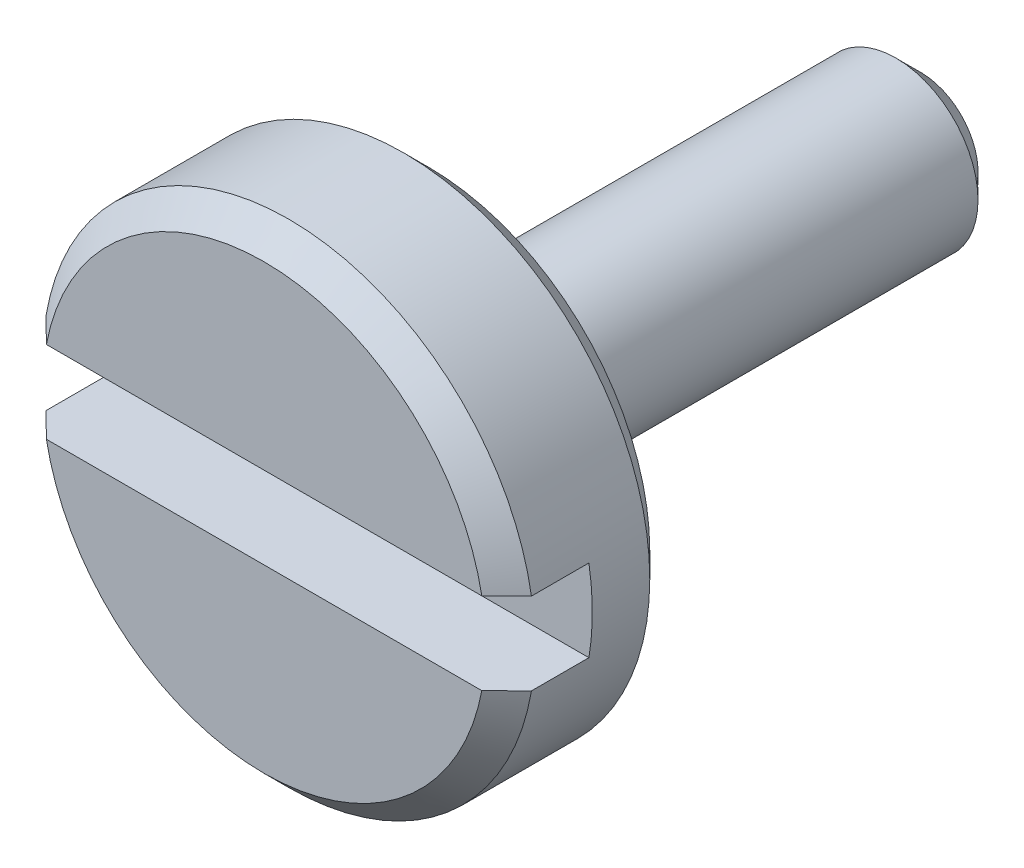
from build123d import *

# Parameters (mm, degrees)
ESQUISSE1_R             = 30
BOSS_EXTRU_1_DEPTH      = 20
CHANFREIN1_SIZE         = 3
CHANFREIN2_SIZE         = 3
ESQUISSE2_W             = 66.537903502
ESQUISSE2_H             = 10
ENL_V_MAT_EXTRU_1_DEPTH = 10
ESQUISSE4_R             = 10
BOSS_EXTRU_2_DEPTH      = 60
CHANFREIN3_SIZE         = 3
ESQUISSE6_R             = 10
ENL_V_MAT_EXTRU_3_DEPTH = 1.25
ENL_V_MAT_EXTRU_4_DEPTH = 1


with BuildPart() as part:
    # Esquisse1 → Boss.-Extru.1 (new body)
    with BuildSketch(Plane.XY):
        Circle(ESQUISSE1_R)
    extrude(amount=BOSS_EXTRU_1_DEPTH)

    # Chanfrein1
    chanfrein1_edges = [part.edges().sort_by_distance(p)[0] for p in [
        (-30, 0, 20),
    ]]
    chamfer(chanfrein1_edges, length=CHANFREIN1_SIZE)

    # Chanfrein2
    chanfrein2_edges = [part.edges().sort_by_distance(p)[0] for p in [
        (-30, 0, 0),
    ]]
    chamfer(chanfrein2_edges, length=CHANFREIN2_SIZE)

    # Esquisse2 → Enl_v. mat.-Extru.1 (cut)
    with BuildSketch(Plane.XY.offset(20)):
        with Locations((1.429332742, 0)):
            Rectangle(ESQUISSE2_W, ESQUISSE2_H)
    extrude(amount=-ENL_V_MAT_EXTRU_1_DEPTH, mode=Mode.SUBTRACT)

    # Esquisse4 → Boss.-Extru.2 (add)
    with BuildSketch(Plane(origin=(0, 0, 0), x_dir=(-1, 0, 0), z_dir=(0, 0, -1))):
        with Locations(Location((0, 0, 0), (0, 0, 180))):
            Circle(ESQUISSE4_R)
    extrude(amount=BOSS_EXTRU_2_DEPTH)

    # Chanfrein3
    chanfrein3_edges = [part.edges().sort_by_distance(p)[0] for p in [
        (-10, 0, -60),
    ]]
    chamfer(chanfrein3_edges, length=CHANFREIN3_SIZE)

    # Esquisse6 → Enl_v. mat.-Extru.3 (cut, symmetric)
    with BuildSketch(Plane(origin=(0, 0, 0), x_dir=(1, 0, 0), z_dir=(0, 1, 0))):
        with Locations((-17, 44.122962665)):
            Circle(ESQUISSE6_R)
    extrude(amount=ENL_V_MAT_EXTRU_3_DEPTH, both=True, mode=Mode.SUBTRACT)

    # Esquisse7 → Enl_v. mat.-Extru.4 (cut)
    with BuildSketch(Plane(origin=(0, 0, -60), x_dir=(-1, 0, 0), z_dir=(0, 0, -1))):
        with BuildLine():
            Line((-1.491585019, -0.955579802), (-1.195711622, -0.778195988))
            add(Edge.make_bspline(
                [(-1.195711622, -0.778195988), (-1.168193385, -0.824260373), (-1.115469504, -0.912517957), (-1.027518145, -1.031775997), (-0.936385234, -1.133138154), (-0.8413959, -1.216014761), (-0.743129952, -1.281263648), (-0.640945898, -1.32746588), (-0.535188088, -1.356281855), (-0.463214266, -1.359781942), (-0.427282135, -1.361529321)],
                knots=[0, 0, 0, 0, 1.272034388, 2.437168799, 3.508375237, 4.49857839, 5.41946034, 6.295179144, 7.148887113, 8, 8, 8, 8], degree=3))
            add(Edge.make_bspline(
                [(-0.427282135, -1.361529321), (-0.396595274, -1.360674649), (-0.335758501, -1.358980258), (-0.246196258, -1.342699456), (-0.159214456, -1.317687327), (-0.076605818, -1.281866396), (0.000489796, -1.23852791), (0.068096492, -1.186181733), (0.126542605, -1.127575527), (0.174351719, -1.062192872), (0.211031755, -0.991875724), (0.239223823, -0.919699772), (0.254868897, -0.844531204), (0.25722565, -0.793920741), (0.258414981, -0.768380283)],
                knots=[0, 0, 0, 0, 1.095163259, 2.171163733, 3.241058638, 4.321873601, 5.38011039, 6.391990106, 7.366004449, 8.327778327, 9.272591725, 10.192022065, 11.087607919, 12, 12, 12, 12], degree=3))
            add(Edge.make_bspline(
                [(0.258414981, -0.768380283), (0.25694067, -0.739239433), (0.253943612, -0.680000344), (0.228612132, -0.592600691), (0.188762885, -0.506108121), (0.152000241, -0.452606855), (0.132914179, -0.424830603)],
                knots=[0, 0, 0, 0, 0.938893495, 1.908633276, 2.914225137, 4, 4, 4, 4], degree=3))
            add(Edge.make_bspline(
                [(0.132914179, -0.424830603), (0.117243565, -0.40478378), (0.084345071, -0.362697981), (0.027787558, -0.300052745), (-0.038578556, -0.235434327), (-0.112482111, -0.16637527), (-0.1966152, -0.096087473), (-0.288342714, -0.021219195), (-0.390006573, 0.055382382), (-0.46130607, 0.106754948), (-0.498095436, 0.133262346)],
                knots=[0, 0, 0, 0, 0.722233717, 1.516239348, 2.393582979, 3.351407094, 4.387010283, 5.505090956, 6.712668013, 8, 8, 8, 8], degree=3))
            add(Edge.make_bspline(
                [(-0.498095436, 0.133262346), (-0.534919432, 0.159490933), (-0.605324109, 0.209637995), (-0.703782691, 0.284062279), (-0.791827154, 0.352106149), (-0.869066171, 0.414410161), (-0.935465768, 0.470982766), (-0.991549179, 0.521280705), (-1.035887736, 0.566664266), (-1.060543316, 0.596105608), (-1.071613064, 0.609324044)],
                knots=[0, 0, 0, 0, 1.452282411, 2.77665338, 3.964542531, 5.026858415, 5.96415736, 6.766646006, 7.446254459, 8, 8, 8, 8], degree=3))
            add(Edge.make_bspline(
                [(-1.071613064, 0.609324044), (-1.08708561, 0.629925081), (-1.117514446, 0.670439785), (-1.157680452, 0.733764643), (-1.191819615, 0.798587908), (-1.218581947, 0.865083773), (-1.241118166, 0.932318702), (-1.256276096, 1.001169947), (-1.265767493, 1.071328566), (-1.26673948, 1.118542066), (-1.267226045, 1.142176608)],
                knots=[0, 0, 0, 0, 1.068054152, 2.10047183, 3.106115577, 4.101338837, 5.06977816, 6.043150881, 7.020423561, 8, 8, 8, 8], degree=3))
            add(Edge.make_bspline(
                [(-1.267226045, 1.142176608), (-1.265920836, 1.179206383), (-1.263338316, 1.252474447), (-1.241497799, 1.359505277), (-1.207024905, 1.461691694), (-1.158730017, 1.558022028), (-1.096472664, 1.645988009), (-1.02442669, 1.726601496), (-0.938615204, 1.794370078), (-0.84446258, 1.853582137), (-0.741406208, 1.899928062), (-0.633415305, 1.934889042), (-0.520318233, 1.9546983), (-0.443715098, 1.957541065), (-0.404846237, 1.958983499)],
                knots=[0, 0, 0, 0, 1.005424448, 1.989358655, 2.955360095, 3.929531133, 4.905563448, 5.876582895, 6.856512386, 7.866279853, 8.892233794, 9.918561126, 10.94386622, 12, 12, 12, 12], degree=3))
            add(Edge.make_bspline(
                [(-0.404846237, 1.958983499), (-0.363602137, 1.957560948), (-0.281580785, 1.954731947), (-0.16093157, 1.930134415), (-0.044770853, 1.889433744), (0.048672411, 1.843245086), (0.121805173, 1.79711367), (0.177577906, 1.755093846), (0.234095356, 1.706718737), (0.291813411, 1.651859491), (0.349754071, 1.59001274), (0.408777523, 1.521602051), (0.469021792, 1.447045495), (0.507777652, 1.393820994), (0.52764575, 1.366535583)],
                knots=[0, 0, 0, 0, 1.286793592, 2.559021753, 3.825965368, 5.121522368, 5.803751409, 6.523245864, 7.299691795, 8.125521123, 9.008227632, 9.944561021, 10.946284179, 12, 12, 12, 12], degree=3))
            Line((0.52764575, 1.366535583), (0.243691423, 1.151291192))
            add(Edge.make_bspline(
                [(0.243691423, 1.151291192), (0.22654549, 1.173379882), (0.193526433, 1.215917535), (0.143396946, 1.275488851), (0.096148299, 1.329905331), (0.049597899, 1.377170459), (0.006204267, 1.419872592), (-0.035912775, 1.456432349), (-0.076147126, 1.487207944), (-0.126864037, 1.520051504), (-0.190581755, 1.552608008), (-0.270566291, 1.580157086), (-0.354152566, 1.596712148), (-0.411082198, 1.598901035), (-0.439902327, 1.60000914)],
                knots=[0, 0, 0, 0, 1.181633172, 2.275549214, 3.290209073, 4.226197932, 5.078386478, 5.862611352, 6.581680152, 7.217281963, 8.414376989, 9.595101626, 10.782541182, 12, 12, 12, 12], degree=3))
            add(Edge.make_bspline(
                [(-0.439902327, 1.60000914), (-0.47605885, 1.598797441), (-0.545783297, 1.596460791), (-0.644773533, 1.570940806), (-0.733867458, 1.530758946), (-0.810420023, 1.474443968), (-0.874157, 1.407722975), (-0.920262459, 1.33094412), (-0.948012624, 1.246161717), (-0.951398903, 1.187020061), (-0.953123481, 1.156900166)],
                knots=[0, 0, 0, 0, 1.14458467, 2.207223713, 3.21896685, 4.227309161, 5.202851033, 6.127160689, 7.046193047, 8, 8, 8, 8], degree=3))
            add(Edge.make_bspline(
                [(-0.953123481, 1.156900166), (-0.952730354, 1.138148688), (-0.951943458, 1.100615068), (-0.940968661, 1.045163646), (-0.926869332, 0.989852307), (-0.9045267, 0.934929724), (-0.873681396, 0.879435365), (-0.83317622, 0.822413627), (-0.782162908, 0.763361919), (-0.743085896, 0.724954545), (-0.72245441, 0.704676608)],
                knots=[0, 0, 0, 0, 0.858281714, 1.717966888, 2.583508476, 3.4729293, 4.427298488, 5.488583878, 6.674047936, 8, 8, 8, 8], degree=3))
            add(Edge.make_bspline(
                [(-0.72245441, 0.704676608), (-0.714793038, 0.697839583), (-0.696591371, 0.681596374), (-0.663315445, 0.655004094), (-0.619372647, 0.622201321), (-0.565910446, 0.581614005), (-0.501943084, 0.534532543), (-0.427463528, 0.481558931), (-0.343301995, 0.420973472), (-0.283580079, 0.378615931), (-0.252001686, 0.356219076)],
                knots=[0, 0, 0, 0, 0.420754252, 0.999615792, 1.744751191, 2.668019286, 3.750313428, 4.999500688, 6.413464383, 8, 8, 8, 8], degree=3))
            add(Edge.make_bspline(
                [(-0.252001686, 0.356219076), (-0.214015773, 0.328577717), (-0.140461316, 0.275054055), (-0.035803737, 0.194638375), (0.059090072, 0.115990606), (0.144553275, 0.039612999), (0.221430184, -0.033915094), (0.288867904, -0.105478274), (0.347553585, -0.174563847), (0.410732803, -0.263136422), (0.475290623, -0.371917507), (0.53073213, -0.505195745), (0.565690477, -0.638992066), (0.570261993, -0.728918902), (0.572517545, -0.773288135)],
                knots=[0, 0, 0, 0, 1.163667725, 2.253281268, 3.268753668, 4.215851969, 5.092017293, 5.902905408, 6.650798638, 7.335211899, 8.59617414, 9.77448103, 10.901945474, 12, 12, 12, 12], degree=3))
            add(Edge.make_bspline(
                [(0.572517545, -0.773288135), (0.571860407, -0.8046665), (0.570558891, -0.866813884), (0.555597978, -0.958068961), (0.533678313, -1.04669983), (0.500641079, -1.131610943), (0.46031792, -1.214355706), (0.409151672, -1.292763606), (0.349843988, -1.368570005), (0.281810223, -1.439753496), (0.20736432, -1.505099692), (0.128680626, -1.563228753), (0.045630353, -1.611697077), (-0.041335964, -1.651247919), (-0.132238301, -1.682181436), (-0.227046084, -1.704594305), (-0.325915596, -1.718350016), (-0.393116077, -1.719777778), (-0.427282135, -1.72050368)],
                knots=[0, 0, 0, 0, 0.983748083, 1.948392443, 2.894712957, 3.844097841, 4.80183111, 5.778335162, 6.776009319, 7.81870978, 8.863265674, 9.881300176, 10.883814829, 11.87499822, 12.874611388, 13.892143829, 14.928324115, 16, 16, 16, 16], degree=3))
            add(Edge.make_bspline(
                [(-0.427282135, -1.72050368), (-0.453717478, -1.719992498), (-0.506255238, -1.718976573), (-0.58396472, -1.709995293), (-0.660104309, -1.697288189), (-0.733718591, -1.677114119), (-0.805756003, -1.652637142), (-0.875903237, -1.622498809), (-0.944194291, -1.586381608), (-1.011011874, -1.545086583), (-1.076186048, -1.497028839), (-1.139105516, -1.441055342), (-1.201834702, -1.378709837), (-1.262522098, -1.308299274), (-1.322395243, -1.230961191), (-1.380273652, -1.145972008), (-1.43735537, -1.053794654), (-1.473170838, -0.988929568), (-1.491585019, -0.955579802)],
                knots=[0, 0, 0, 0, 0.915332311, 1.819136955, 2.706846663, 3.586547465, 4.459518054, 5.340707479, 6.227863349, 7.133153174, 8.059268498, 9.028702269, 10.047606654, 11.120612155, 12.245963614, 13.433783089, 14.680604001, 16, 16, 16, 16], degree=3))
        make_face()
    extrude(amount=-ENL_V_MAT_EXTRU_4_DEPTH, mode=Mode.SUBTRACT)


solid = part.part
